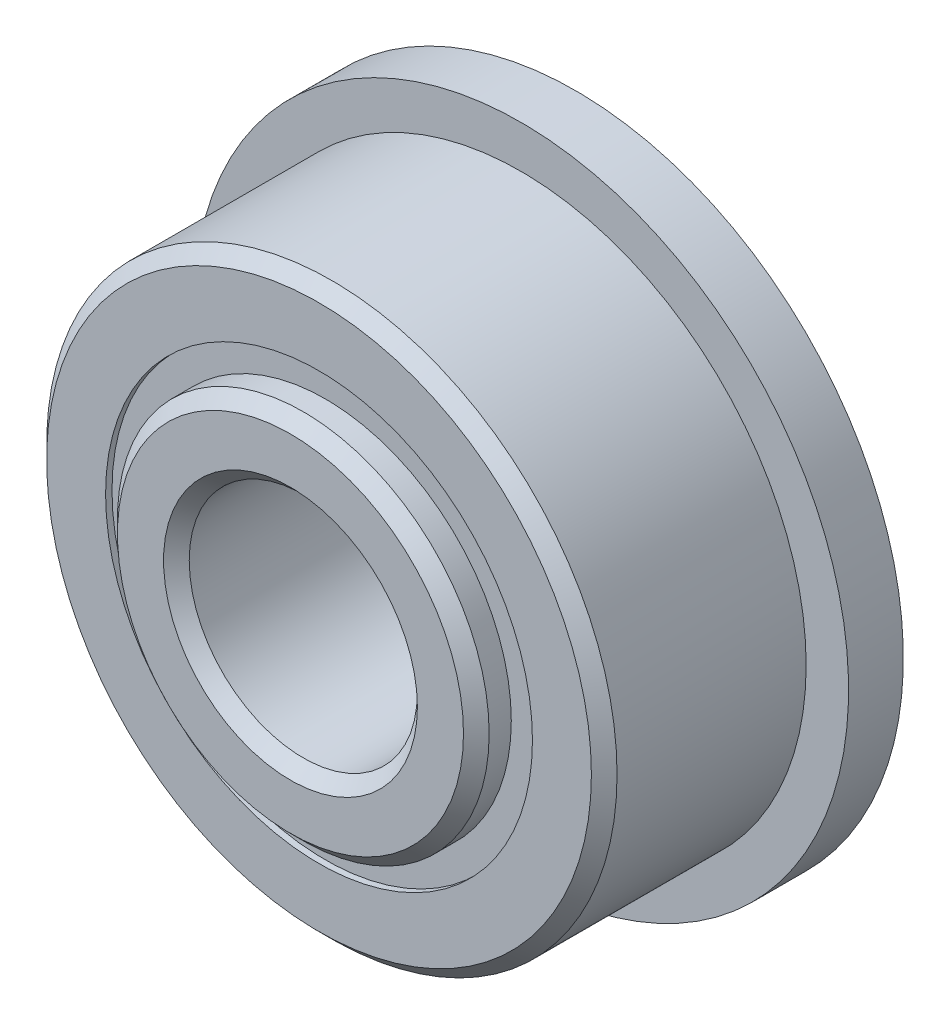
ISO-10303-21;
HEADER;
FILE_DESCRIPTION(('STEP AP214'),'2;1');
FILE_NAME('part.step','',(''),(''),'','','');
FILE_SCHEMA(('AUTOMOTIVE_DESIGN { 1 0 10303 214 1 1 1 1 }'));
ENDSEC;
DATA;
#1=APPLICATION_CONTEXT('core data for automotive mechanical design processes');
#2=APPLICATION_PROTOCOL_DEFINITION('international standard','automotive_design',2000,#1);
#3=PRODUCT_CONTEXT('',#1,'mechanical');
#4=PRODUCT('Part','Part','',(#3));
#5=PRODUCT_RELATED_PRODUCT_CATEGORY('part','',(#4));
#6=PRODUCT_DEFINITION_FORMATION('','',#4);
#7=PRODUCT_DEFINITION_CONTEXT('part definition',#1,'design');
#8=PRODUCT_DEFINITION('design','',#6,#7);
#9=PRODUCT_DEFINITION_SHAPE('','',#8);
#10=(LENGTH_UNIT() NAMED_UNIT(*) SI_UNIT(.MILLI.,.METRE.));
#11=(NAMED_UNIT(*) PLANE_ANGLE_UNIT() SI_UNIT($,.RADIAN.));
#12=(NAMED_UNIT(*) SI_UNIT($,.STERADIAN.) SOLID_ANGLE_UNIT());
#13=UNCERTAINTY_MEASURE_WITH_UNIT(LENGTH_MEASURE(1.E-05),#10,'distance_accuracy_value','');
#14=(GEOMETRIC_REPRESENTATION_CONTEXT(3) GLOBAL_UNCERTAINTY_ASSIGNED_CONTEXT((#13)) GLOBAL_UNIT_ASSIGNED_CONTEXT((#10,
#11,#12)) REPRESENTATION_CONTEXT('',''));
#15=CARTESIAN_POINT('',(0.,0.,0.));
#16=DIRECTION('',(0.,0.,1.));
#17=DIRECTION('',(1.,0.,0.));
#18=AXIS2_PLACEMENT_3D('',#15,#16,#17);
#19=CARTESIAN_POINT('',(0.,2.97002060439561,-1.696640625));
#20=DIRECTION('',(0.,0.,1.));
#21=DIRECTION('',(1.,0.,0.));
#22=AXIS2_PLACEMENT_3D('',#19,#20,#21);
#23=PLANE('',#22);
#24=CARTESIAN_POINT('',(0.,0.,-1.696640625));
#25=DIRECTION('',(0.,0.,1.));
#26=DIRECTION('',(1.,0.,0.));
#27=AXIS2_PLACEMENT_3D('',#24,#25,#26);
#28=CIRCLE('',#27,2.97002060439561);
#29=CARTESIAN_POINT('',(2.97002060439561,0.,-1.696640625));
#30=VERTEX_POINT('',#29);
#31=EDGE_CURVE('E64',#30,#30,#28,.T.);
#32=ORIENTED_EDGE('',*,*,#31,.F.);
#33=EDGE_LOOP('',(#32));
#34=FACE_BOUND('',#33,.T.);
#35=CARTESIAN_POINT('',(0.,0.,-1.696640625));
#36=DIRECTION('',(0.,0.,1.));
#37=DIRECTION('',(1.,0.,0.));
#38=AXIS2_PLACEMENT_3D('',#35,#36,#37);
#39=CIRCLE('',#38,2.5862293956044);
#40=CARTESIAN_POINT('',(2.5862293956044,0.,-1.696640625));
#41=VERTEX_POINT('',#40);
#42=EDGE_CURVE('E11',#41,#41,#39,.T.);
#43=ORIENTED_EDGE('',*,*,#42,.T.);
#44=EDGE_LOOP('',(#43));
#45=FACE_BOUND('',#44,.T.);
#46=ADVANCED_FACE('F47',(#34,#45),#23,.F.);
#47=CARTESIAN_POINT('',(0.,0.,1.7859375));
#48=DIRECTION('',(0.,0.,1.));
#49=DIRECTION('',(1.,0.,0.));
#50=AXIS2_PLACEMENT_3D('',#47,#48,#49);
#51=CYLINDRICAL_SURFACE('',#50,2.5862293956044);
#52=ORIENTED_EDGE('',*,*,#42,.F.);
#53=EDGE_LOOP('',(#52));
#54=FACE_BOUND('',#53,.T.);
#55=CARTESIAN_POINT('',(0.,0.,-0.816616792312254));
#56=DIRECTION('',(0.,0.,1.));
#57=DIRECTION('',(1.,0.,0.));
#58=AXIS2_PLACEMENT_3D('',#55,#56,#57);
#59=CIRCLE('',#58,2.5862293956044);
#60=CARTESIAN_POINT('',(2.5862293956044,0.,-0.816616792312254));
#61=VERTEX_POINT('',#60);
#62=EDGE_CURVE('E54',#61,#61,#59,.T.);
#63=ORIENTED_EDGE('',*,*,#62,.T.);
#64=EDGE_LOOP('',(#63));
#65=FACE_BOUND('',#64,.T.);
#66=ADVANCED_FACE('F74',(#54,#65),#51,.F.);
#67=CARTESIAN_POINT('',(0.,2.9700206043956,-0.816616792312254));
#68=DIRECTION('',(0.,0.,-1.));
#69=DIRECTION('',(-1.,0.,0.));
#70=AXIS2_PLACEMENT_3D('',#67,#68,#69);
#71=PLANE('',#70);
#72=ORIENTED_EDGE('',*,*,#62,.F.);
#73=EDGE_LOOP('',(#72));
#74=FACE_BOUND('',#73,.T.);
#75=CARTESIAN_POINT('',(0.,0.,-0.816616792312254));
#76=DIRECTION('',(0.,0.,1.));
#77=DIRECTION('',(1.,0.,0.));
#78=AXIS2_PLACEMENT_3D('',#75,#76,#77);
#79=CIRCLE('',#78,2.9700206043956);
#80=CARTESIAN_POINT('',(2.9700206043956,0.,-0.816616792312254));
#81=VERTEX_POINT('',#80);
#82=EDGE_CURVE('E60',#81,#81,#79,.T.);
#83=ORIENTED_EDGE('',*,*,#82,.T.);
#84=EDGE_LOOP('',(#83));
#85=FACE_BOUND('',#84,.T.);
#86=ADVANCED_FACE('F78',(#74,#85),#71,.F.);
#87=CARTESIAN_POINT('',(0.,0.,1.7859375));
#88=DIRECTION('',(0.,0.,1.));
#89=DIRECTION('',(1.,0.,0.));
#90=AXIS2_PLACEMENT_3D('',#87,#88,#89);
#91=CYLINDRICAL_SURFACE('',#90,2.9700206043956);
#92=ORIENTED_EDGE('',*,*,#82,.F.);
#93=EDGE_LOOP('',(#92));
#94=FACE_BOUND('',#93,.T.);
#95=ORIENTED_EDGE('',*,*,#31,.T.);
#96=EDGE_LOOP('',(#95));
#97=FACE_BOUND('',#96,.T.);
#98=ADVANCED_FACE('F71',(#94,#97),#91,.T.);
#99=CLOSED_SHELL('',(#46,#66,#86,#98));
#100=MANIFOLD_SOLID_BREP('B2',#99);
#101=CARTESIAN_POINT('',(0.,2.9700206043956,1.696640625));
#102=DIRECTION('',(0.,0.,-1.));
#103=DIRECTION('',(-1.,0.,0.));
#104=AXIS2_PLACEMENT_3D('',#101,#102,#103);
#105=PLANE('',#104);
#106=CARTESIAN_POINT('',(0.,0.,1.696640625));
#107=DIRECTION('',(0.,0.,1.));
#108=DIRECTION('',(1.,0.,0.));
#109=AXIS2_PLACEMENT_3D('',#106,#107,#108);
#110=CIRCLE('',#109,2.5862293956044);
#111=CARTESIAN_POINT('',(2.5862293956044,0.,1.696640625));
#112=VERTEX_POINT('',#111);
#113=EDGE_CURVE('E46',#112,#112,#110,.T.);
#114=ORIENTED_EDGE('',*,*,#113,.F.);
#115=EDGE_LOOP('',(#114));
#116=FACE_BOUND('',#115,.T.);
#117=CARTESIAN_POINT('',(0.,0.,1.696640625));
#118=DIRECTION('',(0.,0.,1.));
#119=DIRECTION('',(1.,0.,0.));
#120=AXIS2_PLACEMENT_3D('',#117,#118,#119);
#121=CIRCLE('',#120,2.9700206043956);
#122=CARTESIAN_POINT('',(2.9700206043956,0.,1.696640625));
#123=VERTEX_POINT('',#122);
#124=EDGE_CURVE('E139',#123,#123,#121,.T.);
#125=ORIENTED_EDGE('',*,*,#124,.T.);
#126=EDGE_LOOP('',(#125));
#127=FACE_BOUND('',#126,.T.);
#128=ADVANCED_FACE('F122',(#116,#127),#105,.F.);
#129=CARTESIAN_POINT('',(0.,0.,1.7859375));
#130=DIRECTION('',(0.,0.,1.));
#131=DIRECTION('',(1.,0.,0.));
#132=AXIS2_PLACEMENT_3D('',#129,#130,#131);
#133=CYLINDRICAL_SURFACE('',#132,2.5862293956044);
#134=CARTESIAN_POINT('',(0.,0.,0.816616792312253));
#135=DIRECTION('',(0.,0.,1.));
#136=DIRECTION('',(1.,0.,0.));
#137=AXIS2_PLACEMENT_3D('',#134,#135,#136);
#138=CIRCLE('',#137,2.5862293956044);
#139=CARTESIAN_POINT('',(2.5862293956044,0.,0.816616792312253));
#140=VERTEX_POINT('',#139);
#141=EDGE_CURVE('E129',#140,#140,#138,.T.);
#142=ORIENTED_EDGE('',*,*,#141,.F.);
#143=EDGE_LOOP('',(#142));
#144=FACE_BOUND('',#143,.T.);
#145=ORIENTED_EDGE('',*,*,#113,.T.);
#146=EDGE_LOOP('',(#145));
#147=FACE_BOUND('',#146,.T.);
#148=ADVANCED_FACE('F155',(#144,#147),#133,.F.);
#149=CARTESIAN_POINT('',(0.,2.9700206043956,0.816616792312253));
#150=DIRECTION('',(0.,0.,1.));
#151=DIRECTION('',(1.,0.,0.));
#152=AXIS2_PLACEMENT_3D('',#149,#150,#151);
#153=PLANE('',#152);
#154=CARTESIAN_POINT('',(0.,0.,0.816616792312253));
#155=DIRECTION('',(0.,0.,1.));
#156=DIRECTION('',(1.,0.,0.));
#157=AXIS2_PLACEMENT_3D('',#154,#155,#156);
#158=CIRCLE('',#157,2.9700206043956);
#159=CARTESIAN_POINT('',(2.9700206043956,0.,0.816616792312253));
#160=VERTEX_POINT('',#159);
#161=EDGE_CURVE('E135',#160,#160,#158,.T.);
#162=ORIENTED_EDGE('',*,*,#161,.F.);
#163=EDGE_LOOP('',(#162));
#164=FACE_BOUND('',#163,.T.);
#165=ORIENTED_EDGE('',*,*,#141,.T.);
#166=EDGE_LOOP('',(#165));
#167=FACE_BOUND('',#166,.T.);
#168=ADVANCED_FACE('F150',(#164,#167),#153,.F.);
#169=CARTESIAN_POINT('',(0.,0.,1.7859375));
#170=DIRECTION('',(0.,0.,1.));
#171=DIRECTION('',(1.,0.,0.));
#172=AXIS2_PLACEMENT_3D('',#169,#170,#171);
#173=CYLINDRICAL_SURFACE('',#172,2.9700206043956);
#174=ORIENTED_EDGE('',*,*,#124,.F.);
#175=EDGE_LOOP('',(#174));
#176=FACE_BOUND('',#175,.T.);
#177=ORIENTED_EDGE('',*,*,#161,.T.);
#178=EDGE_LOOP('',(#177));
#179=FACE_BOUND('',#178,.T.);
#180=ADVANCED_FACE('F147',(#176,#179),#173,.T.);
#181=CLOSED_SHELL('',(#128,#148,#168,#180));
#182=MANIFOLD_SOLID_BREP('B6',#181);
#183=CARTESIAN_POINT('',(-1.632940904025,2.24755033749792,0.));
#184=DIRECTION('',(0.,0.,1.));
#185=DIRECTION('',(-0.587785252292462,0.809016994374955,0.));
#186=AXIS2_PLACEMENT_3D('',#183,#184,#185);
#187=SPHERICAL_SURFACE('',#186,0.816616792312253);
#188=CARTESIAN_POINT('',(-1.632940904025,2.24755033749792,0.816616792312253));
#189=VERTEX_POINT('',#188);
#190=VERTEX_LOOP('',#189);
#191=FACE_BOUND('',#190,.T.);
#192=ADVANCED_FACE('F197',(#191),#187,.T.);
#193=CLOSED_SHELL('',(#192));
#194=MANIFOLD_SOLID_BREP('B41',#193);
#195=CARTESIAN_POINT('',(-2.64215388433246,0.858487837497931,0.));
#196=DIRECTION('',(0.,0.,1.));
#197=DIRECTION('',(-0.95105651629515,0.309016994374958,0.));
#198=AXIS2_PLACEMENT_3D('',#195,#196,#197);
#199=SPHERICAL_SURFACE('',#198,0.816616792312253);
#200=CARTESIAN_POINT('',(-2.64215388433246,0.858487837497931,0.816616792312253));
#201=VERTEX_POINT('',#200);
#202=VERTEX_LOOP('',#201);
#203=FACE_BOUND('',#202,.T.);
#204=ADVANCED_FACE('F218',(#203),#199,.T.);
#205=CLOSED_SHELL('',(#204));
#206=MANIFOLD_SOLID_BREP('B118',#205);
#207=CARTESIAN_POINT('',(-2.64215388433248,-0.858487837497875,0.));
#208=DIRECTION('',(0.,0.,1.));
#209=DIRECTION('',(-0.951056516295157,-0.309016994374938,0.));
#210=AXIS2_PLACEMENT_3D('',#207,#208,#209);
#211=SPHERICAL_SURFACE('',#210,0.816616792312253);
#212=CARTESIAN_POINT('',(-2.64215388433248,-0.858487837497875,0.816616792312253));
#213=VERTEX_POINT('',#212);
#214=VERTEX_LOOP('',#213);
#215=FACE_BOUND('',#214,.T.);
#216=ADVANCED_FACE('F239',(#215),#211,.T.);
#217=CLOSED_SHELL('',(#216));
#218=MANIFOLD_SOLID_BREP('B193',#217);
#219=CARTESIAN_POINT('',(-1.63294090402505,-2.24755033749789,0.));
#220=DIRECTION('',(0.,0.,1.));
#221=DIRECTION('',(-0.58778525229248,-0.809016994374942,0.));
#222=AXIS2_PLACEMENT_3D('',#219,#220,#221);
#223=SPHERICAL_SURFACE('',#222,0.816616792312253);
#224=CARTESIAN_POINT('',(-1.63294090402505,-2.24755033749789,0.816616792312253));
#225=VERTEX_POINT('',#224);
#226=VERTEX_LOOP('',#225);
#227=FACE_BOUND('',#226,.T.);
#228=ADVANCED_FACE('F260',(#227),#223,.T.);
#229=CLOSED_SHELL('',(#228));
#230=MANIFOLD_SOLID_BREP('B214',#229);
#231=CARTESIAN_POINT('',(0.,-2.778125,0.));
#232=DIRECTION('',(0.,0.,1.));
#233=DIRECTION('',(0.,-1.,0.));
#234=AXIS2_PLACEMENT_3D('',#231,#232,#233);
#235=SPHERICAL_SURFACE('',#234,0.816616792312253);
#236=CARTESIAN_POINT('',(0.,-2.778125,0.816616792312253));
#237=VERTEX_POINT('',#236);
#238=VERTEX_LOOP('',#237);
#239=FACE_BOUND('',#238,.T.);
#240=ADVANCED_FACE('F281',(#239),#235,.T.);
#241=CLOSED_SHELL('',(#240));
#242=MANIFOLD_SOLID_BREP('B235',#241);
#243=CARTESIAN_POINT('',(1.63294090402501,-2.24755033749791,0.));
#244=DIRECTION('',(0.,0.,1.));
#245=DIRECTION('',(0.587785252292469,-0.809016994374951,0.));
#246=AXIS2_PLACEMENT_3D('',#243,#244,#245);
#247=SPHERICAL_SURFACE('',#246,0.816616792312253);
#248=CARTESIAN_POINT('',(1.63294090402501,-2.24755033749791,0.816616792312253));
#249=VERTEX_POINT('',#248);
#250=VERTEX_LOOP('',#249);
#251=FACE_BOUND('',#250,.T.);
#252=ADVANCED_FACE('F302',(#251),#247,.T.);
#253=CLOSED_SHELL('',(#252));
#254=MANIFOLD_SOLID_BREP('B256',#253);
#255=CARTESIAN_POINT('',(2.64215388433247,-0.858487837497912,0.));
#256=DIRECTION('',(0.,0.,1.));
#257=DIRECTION('',(0.951056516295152,-0.309016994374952,0.));
#258=AXIS2_PLACEMENT_3D('',#255,#256,#257);
#259=SPHERICAL_SURFACE('',#258,0.816616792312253);
#260=CARTESIAN_POINT('',(2.64215388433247,-0.858487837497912,0.816616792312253));
#261=VERTEX_POINT('',#260);
#262=VERTEX_LOOP('',#261);
#263=FACE_BOUND('',#262,.T.);
#264=ADVANCED_FACE('F323',(#263),#259,.T.);
#265=CLOSED_SHELL('',(#264));
#266=MANIFOLD_SOLID_BREP('B277',#265);
#267=CARTESIAN_POINT('',(2.64215388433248,0.858487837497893,0.));
#268=DIRECTION('',(0.,0.,1.));
#269=DIRECTION('',(0.951056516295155,0.309016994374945,0.));
#270=AXIS2_PLACEMENT_3D('',#267,#268,#269);
#271=SPHERICAL_SURFACE('',#270,0.816616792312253);
#272=CARTESIAN_POINT('',(2.64215388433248,0.858487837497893,0.816616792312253));
#273=VERTEX_POINT('',#272);
#274=VERTEX_LOOP('',#273);
#275=FACE_BOUND('',#274,.T.);
#276=ADVANCED_FACE('F343',(#275),#271,.T.);
#277=CLOSED_SHELL('',(#276));
#278=MANIFOLD_SOLID_BREP('B298',#277);
#279=CARTESIAN_POINT('',(1.63294090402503,2.2475503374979,0.));
#280=DIRECTION('',(0.,0.,1.));
#281=DIRECTION('',(0.587785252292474,0.809016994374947,0.));
#282=AXIS2_PLACEMENT_3D('',#279,#280,#281);
#283=SPHERICAL_SURFACE('',#282,0.816616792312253);
#284=CARTESIAN_POINT('',(1.63294090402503,2.2475503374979,0.816616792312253));
#285=VERTEX_POINT('',#284);
#286=VERTEX_LOOP('',#285);
#287=FACE_BOUND('',#286,.T.);
#288=ADVANCED_FACE('F364',(#287),#283,.T.);
#289=CLOSED_SHELL('',(#288));
#290=MANIFOLD_SOLID_BREP('B319',#289);
#291=CARTESIAN_POINT('',(0.,2.778125,0.));
#292=DIRECTION('',(0.,0.,1.));
#293=DIRECTION('',(0.,1.,0.));
#294=AXIS2_PLACEMENT_3D('',#291,#292,#293);
#295=SPHERICAL_SURFACE('',#294,0.816616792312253);
#296=CARTESIAN_POINT('',(0.,2.778125,0.816616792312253));
#297=VERTEX_POINT('',#296);
#298=VERTEX_LOOP('',#297);
#299=FACE_BOUND('',#298,.T.);
#300=ADVANCED_FACE('F387',(#299),#295,.T.);
#301=CLOSED_SHELL('',(#300));
#302=MANIFOLD_SOLID_BREP('B339',#301);
#303=CARTESIAN_POINT('',(0.,0.,2.00453625));
#304=DIRECTION('',(0.,0.,-1.));
#305=DIRECTION('',(-1.,0.,0.));
#306=AXIS2_PLACEMENT_3D('',#303,#304,#305);
#307=CONICAL_SURFACE('',#306,2.5862293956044,0.785398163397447);
#308=CARTESIAN_POINT('',(0.,0.,2.18313));
#309=DIRECTION('',(0.,0.,1.));
#310=DIRECTION('',(1.,0.,0.));
#311=AXIS2_PLACEMENT_3D('',#308,#309,#310);
#312=CIRCLE('',#311,2.4076356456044);
#313=CARTESIAN_POINT('',(2.4076356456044,0.,2.18313));
#314=VERTEX_POINT('',#313);
#315=EDGE_CURVE('E451',#314,#314,#312,.T.);
#316=ORIENTED_EDGE('',*,*,#315,.F.);
#317=EDGE_LOOP('',(#316));
#318=FACE_BOUND('',#317,.T.);
#319=CARTESIAN_POINT('',(0.,0.,2.00453625));
#320=DIRECTION('',(0.,0.,1.));
#321=DIRECTION('',(1.,0.,0.));
#322=AXIS2_PLACEMENT_3D('',#319,#320,#321);
#323=CIRCLE('',#322,2.5862293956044);
#324=CARTESIAN_POINT('',(2.5862293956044,0.,2.00453625));
#325=VERTEX_POINT('',#324);
#326=EDGE_CURVE('E386',#325,#325,#323,.T.);
#327=ORIENTED_EDGE('',*,*,#326,.T.);
#328=EDGE_LOOP('',(#327));
#329=FACE_BOUND('',#328,.T.);
#330=ADVANCED_FACE('F407',(#318,#329),#307,.T.);
#331=CARTESIAN_POINT('',(0.,0.,1.7859375));
#332=DIRECTION('',(0.,0.,1.));
#333=DIRECTION('',(1.,0.,0.));
#334=AXIS2_PLACEMENT_3D('',#331,#332,#333);
#335=CYLINDRICAL_SURFACE('',#334,2.5862293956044);
#336=ORIENTED_EDGE('',*,*,#326,.F.);
#337=EDGE_LOOP('',(#336));
#338=FACE_BOUND('',#337,.T.);
#339=CARTESIAN_POINT('',(0.,0.,0.793749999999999));
#340=DIRECTION('',(0.,0.,1.));
#341=DIRECTION('',(1.,0.,0.));
#342=AXIS2_PLACEMENT_3D('',#339,#340,#341);
#343=CIRCLE('',#342,2.5862293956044);
#344=CARTESIAN_POINT('',(2.5862293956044,0.,0.793749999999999));
#345=VERTEX_POINT('',#344);
#346=EDGE_CURVE('E414',#345,#345,#343,.T.);
#347=ORIENTED_EDGE('',*,*,#346,.T.);
#348=EDGE_LOOP('',(#347));
#349=FACE_BOUND('',#348,.T.);
#350=ADVANCED_FACE('F458',(#338,#349),#335,.T.);
#351=CARTESIAN_POINT('',(0.,0.,0.));
#352=DIRECTION('',(0.,0.,1.));
#353=DIRECTION('',(1.,0.,0.));
#354=AXIS2_PLACEMENT_3D('',#351,#352,#353);
#355=TOROIDAL_SURFACE('',#354,2.77812499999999,0.816616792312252);
#356=ORIENTED_EDGE('',*,*,#346,.F.);
#357=EDGE_LOOP('',(#356));
#358=FACE_BOUND('',#357,.T.);
#359=CARTESIAN_POINT('',(0.,0.,-0.79375));
#360=DIRECTION('',(0.,0.,1.));
#361=DIRECTION('',(1.,0.,0.));
#362=AXIS2_PLACEMENT_3D('',#359,#360,#361);
#363=CIRCLE('',#362,2.5862293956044);
#364=CARTESIAN_POINT('',(2.5862293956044,0.,-0.79375));
#365=VERTEX_POINT('',#364);
#366=EDGE_CURVE('E420',#365,#365,#363,.T.);
#367=ORIENTED_EDGE('',*,*,#366,.T.);
#368=EDGE_LOOP('',(#367));
#369=FACE_BOUND('',#368,.T.);
#370=ADVANCED_FACE('F462',(#358,#369),#355,.F.);
#371=CARTESIAN_POINT('',(0.,0.,1.7859375));
#372=DIRECTION('',(0.,0.,1.));
#373=DIRECTION('',(1.,0.,0.));
#374=AXIS2_PLACEMENT_3D('',#371,#372,#373);
#375=CYLINDRICAL_SURFACE('',#374,2.5862293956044);
#376=ORIENTED_EDGE('',*,*,#366,.F.);
#377=EDGE_LOOP('',(#376));
#378=FACE_BOUND('',#377,.T.);
#379=CARTESIAN_POINT('',(0.,0.,-2.00453625));
#380=DIRECTION('',(0.,0.,1.));
#381=DIRECTION('',(1.,0.,0.));
#382=AXIS2_PLACEMENT_3D('',#379,#380,#381);
#383=CIRCLE('',#382,2.5862293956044);
#384=CARTESIAN_POINT('',(2.5862293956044,0.,-2.00453625));
#385=VERTEX_POINT('',#384);
#386=EDGE_CURVE('E426',#385,#385,#383,.T.);
#387=ORIENTED_EDGE('',*,*,#386,.T.);
#388=EDGE_LOOP('',(#387));
#389=FACE_BOUND('',#388,.T.);
#390=ADVANCED_FACE('F467',(#378,#389),#375,.T.);
#391=CARTESIAN_POINT('',(0.,0.,-2.18313));
#392=DIRECTION('',(0.,0.,1.));
#393=DIRECTION('',(1.,0.,0.));
#394=AXIS2_PLACEMENT_3D('',#391,#392,#393);
#395=CONICAL_SURFACE('',#394,2.4076356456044,0.785398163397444);
#396=ORIENTED_EDGE('',*,*,#386,.F.);
#397=EDGE_LOOP('',(#396));
#398=FACE_BOUND('',#397,.T.);
#399=CARTESIAN_POINT('',(0.,0.,-2.18313));
#400=DIRECTION('',(0.,0.,1.));
#401=DIRECTION('',(1.,0.,0.));
#402=AXIS2_PLACEMENT_3D('',#399,#400,#401);
#403=CIRCLE('',#402,2.4076356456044);
#404=CARTESIAN_POINT('',(2.4076356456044,0.,-2.18313));
#405=VERTEX_POINT('',#404);
#406=EDGE_CURVE('E432',#405,#405,#403,.T.);
#407=ORIENTED_EDGE('',*,*,#406,.T.);
#408=EDGE_LOOP('',(#407));
#409=FACE_BOUND('',#408,.T.);
#410=ADVANCED_FACE('F473',(#398,#409),#395,.T.);
#411=CARTESIAN_POINT('',(0.,2.4076356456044,-2.18313));
#412=DIRECTION('',(0.,0.,1.));
#413=DIRECTION('',(1.,0.,0.));
#414=AXIS2_PLACEMENT_3D('',#411,#412,#413);
#415=PLANE('',#414);
#416=ORIENTED_EDGE('',*,*,#406,.F.);
#417=EDGE_LOOP('',(#416));
#418=FACE_BOUND('',#417,.T.);
#419=CARTESIAN_POINT('',(0.,0.,-2.18313));
#420=DIRECTION('',(0.,0.,1.));
#421=DIRECTION('',(1.,0.,0.));
#422=AXIS2_PLACEMENT_3D('',#419,#420,#421);
#423=CIRCLE('',#422,1.76609375);
#424=CARTESIAN_POINT('',(1.76609375,0.,-2.18313));
#425=VERTEX_POINT('',#424);
#426=EDGE_CURVE('E436',#425,#425,#423,.T.);
#427=ORIENTED_EDGE('',*,*,#426,.T.);
#428=EDGE_LOOP('',(#427));
#429=FACE_BOUND('',#428,.T.);
#430=ADVANCED_FACE('F477',(#418,#429),#415,.F.);
#431=CARTESIAN_POINT('',(0.,0.,-2.00453625));
#432=DIRECTION('',(0.,0.,-1.));
#433=DIRECTION('',(-1.,0.,0.));
#434=AXIS2_PLACEMENT_3D('',#431,#432,#433);
#435=CONICAL_SURFACE('',#434,1.5875,0.785398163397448);
#436=ORIENTED_EDGE('',*,*,#426,.F.);
#437=EDGE_LOOP('',(#436));
#438=FACE_BOUND('',#437,.T.);
#439=CARTESIAN_POINT('',(0.,0.,-2.00453625));
#440=DIRECTION('',(0.,0.,1.));
#441=DIRECTION('',(1.,0.,0.));
#442=AXIS2_PLACEMENT_3D('',#439,#440,#441);
#443=CIRCLE('',#442,1.5875);
#444=CARTESIAN_POINT('',(1.5875,0.,-2.00453625));
#445=VERTEX_POINT('',#444);
#446=EDGE_CURVE('E440',#445,#445,#443,.T.);
#447=ORIENTED_EDGE('',*,*,#446,.T.);
#448=EDGE_LOOP('',(#447));
#449=FACE_BOUND('',#448,.T.);
#450=ADVANCED_FACE('F481',(#438,#449),#435,.F.);
#451=CARTESIAN_POINT('',(0.,0.,1.7859375));
#452=DIRECTION('',(0.,0.,1.));
#453=DIRECTION('',(1.,0.,0.));
#454=AXIS2_PLACEMENT_3D('',#451,#452,#453);
#455=CYLINDRICAL_SURFACE('',#454,1.5875);
#456=ORIENTED_EDGE('',*,*,#446,.F.);
#457=EDGE_LOOP('',(#456));
#458=FACE_BOUND('',#457,.T.);
#459=CARTESIAN_POINT('',(0.,0.,2.00453625));
#460=DIRECTION('',(0.,0.,1.));
#461=DIRECTION('',(1.,0.,0.));
#462=AXIS2_PLACEMENT_3D('',#459,#460,#461);
#463=CIRCLE('',#462,1.5875);
#464=CARTESIAN_POINT('',(1.5875,0.,2.00453625));
#465=VERTEX_POINT('',#464);
#466=EDGE_CURVE('E443',#465,#465,#463,.T.);
#467=ORIENTED_EDGE('',*,*,#466,.T.);
#468=EDGE_LOOP('',(#467));
#469=FACE_BOUND('',#468,.T.);
#470=ADVANCED_FACE('F485',(#458,#469),#455,.F.);
#471=CARTESIAN_POINT('',(0.,0.,2.18313));
#472=DIRECTION('',(0.,0.,1.));
#473=DIRECTION('',(1.,0.,0.));
#474=AXIS2_PLACEMENT_3D('',#471,#472,#473);
#475=CONICAL_SURFACE('',#474,1.76609375,0.785398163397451);
#476=ORIENTED_EDGE('',*,*,#466,.F.);
#477=EDGE_LOOP('',(#476));
#478=FACE_BOUND('',#477,.T.);
#479=CARTESIAN_POINT('',(0.,0.,2.18313));
#480=DIRECTION('',(0.,0.,1.));
#481=DIRECTION('',(1.,0.,0.));
#482=AXIS2_PLACEMENT_3D('',#479,#480,#481);
#483=CIRCLE('',#482,1.76609375);
#484=CARTESIAN_POINT('',(1.76609375,0.,2.18313));
#485=VERTEX_POINT('',#484);
#486=EDGE_CURVE('E447',#485,#485,#483,.T.);
#487=ORIENTED_EDGE('',*,*,#486,.T.);
#488=EDGE_LOOP('',(#487));
#489=FACE_BOUND('',#488,.T.);
#490=ADVANCED_FACE('F489',(#478,#489),#475,.F.);
#491=CARTESIAN_POINT('',(0.,1.76609375,2.18313));
#492=DIRECTION('',(0.,0.,-1.));
#493=DIRECTION('',(-1.,0.,0.));
#494=AXIS2_PLACEMENT_3D('',#491,#492,#493);
#495=PLANE('',#494);
#496=ORIENTED_EDGE('',*,*,#486,.F.);
#497=EDGE_LOOP('',(#496));
#498=FACE_BOUND('',#497,.T.);
#499=ORIENTED_EDGE('',*,*,#315,.T.);
#500=EDGE_LOOP('',(#499));
#501=FACE_BOUND('',#500,.T.);
#502=ADVANCED_FACE('F455',(#498,#501),#495,.F.);
#503=CLOSED_SHELL('',(#330,#350,#370,#390,#410,#430,#450,#470,#490,#502));
#504=MANIFOLD_SOLID_BREP('B360',#503);
#505=CARTESIAN_POINT('',(0.,0.,1.60734375));
#506=DIRECTION('',(0.,0.,-1.));
#507=DIRECTION('',(-1.,0.,0.));
#508=AXIS2_PLACEMENT_3D('',#505,#506,#507);
#509=CONICAL_SURFACE('',#508,3.96875,0.785398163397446);
#510=CARTESIAN_POINT('',(0.,0.,1.7859375));
#511=DIRECTION('',(0.,0.,1.));
#512=DIRECTION('',(1.,0.,0.));
#513=AXIS2_PLACEMENT_3D('',#510,#511,#512);
#514=CIRCLE('',#513,3.79015625);
#515=CARTESIAN_POINT('',(3.79015625,0.,1.7859375));
#516=VERTEX_POINT('',#515);
#517=EDGE_CURVE('E605',#516,#516,#514,.T.);
#518=ORIENTED_EDGE('',*,*,#517,.F.);
#519=EDGE_LOOP('',(#518));
#520=FACE_BOUND('',#519,.T.);
#521=CARTESIAN_POINT('',(0.,0.,1.60734375));
#522=DIRECTION('',(0.,0.,1.));
#523=DIRECTION('',(1.,0.,0.));
#524=AXIS2_PLACEMENT_3D('',#521,#522,#523);
#525=CIRCLE('',#524,3.96875);
#526=CARTESIAN_POINT('',(3.96875,0.,1.60734375));
#527=VERTEX_POINT('',#526);
#528=EDGE_CURVE('E406',#527,#527,#525,.T.);
#529=ORIENTED_EDGE('',*,*,#528,.T.);
#530=EDGE_LOOP('',(#529));
#531=FACE_BOUND('',#530,.T.);
#532=ADVANCED_FACE('F575',(#520,#531),#509,.T.);
#533=CARTESIAN_POINT('',(0.,0.,1.7859375));
#534=DIRECTION('',(0.,0.,1.));
#535=DIRECTION('',(1.,0.,0.));
#536=AXIS2_PLACEMENT_3D('',#533,#534,#535);
#537=CYLINDRICAL_SURFACE('',#536,3.96875);
#538=CARTESIAN_POINT('',(0.,0.,-1.0239375));
#539=DIRECTION('',(0.,0.,1.));
#540=DIRECTION('',(1.,0.,0.));
#541=AXIS2_PLACEMENT_3D('',#538,#539,#540);
#542=CIRCLE('',#541,3.96875);
#543=CARTESIAN_POINT('',(3.96875,0.,-1.0239375));
#544=VERTEX_POINT('',#543);
#545=EDGE_CURVE('E608',#544,#544,#542,.T.);
#546=ORIENTED_EDGE('',*,*,#545,.T.);
#547=EDGE_LOOP('',(#546));
#548=FACE_BOUND('',#547,.T.);
#549=ORIENTED_EDGE('',*,*,#528,.F.);
#550=EDGE_LOOP('',(#549));
#551=FACE_BOUND('',#550,.T.);
#552=ADVANCED_FACE('F629',(#548,#551),#537,.T.);
#553=CARTESIAN_POINT('',(0.,3.79015625,-1.7859375));
#554=DIRECTION('',(0.,0.,1.));
#555=DIRECTION('',(1.,0.,0.));
#556=AXIS2_PLACEMENT_3D('',#553,#554,#555);
#557=PLANE('',#556);
#558=CARTESIAN_POINT('',(0.,0.,-1.7859375));
#559=DIRECTION('',(0.,0.,1.));
#560=DIRECTION('',(1.,0.,0.));
#561=AXIS2_PLACEMENT_3D('',#558,#559,#560);
#562=CIRCLE('',#561,2.9700206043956);
#563=CARTESIAN_POINT('',(2.9700206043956,0.,-1.7859375));
#564=VERTEX_POINT('',#563);
#565=EDGE_CURVE('E582',#564,#564,#562,.T.);
#566=ORIENTED_EDGE('',*,*,#565,.T.);
#567=EDGE_LOOP('',(#566));
#568=FACE_BOUND('',#567,.T.);
#569=CARTESIAN_POINT('',(0.,0.,-1.7859375));
#570=DIRECTION('',(0.,0.,-1.));
#571=DIRECTION('',(-1.,0.,0.));
#572=AXIS2_PLACEMENT_3D('',#569,#570,#571);
#573=CIRCLE('',#572,4.5593);
#574=CARTESIAN_POINT('',(-4.5593,0.,-1.7859375));
#575=VERTEX_POINT('',#574);
#576=EDGE_CURVE('E611',#575,#575,#573,.T.);
#577=ORIENTED_EDGE('',*,*,#576,.T.);
#578=EDGE_LOOP('',(#577));
#579=FACE_BOUND('',#578,.T.);
#580=ADVANCED_FACE('F632',(#568,#579),#557,.F.);
#581=CARTESIAN_POINT('',(0.,0.,1.7859375));
#582=DIRECTION('',(0.,0.,1.));
#583=DIRECTION('',(1.,0.,0.));
#584=AXIS2_PLACEMENT_3D('',#581,#582,#583);
#585=CYLINDRICAL_SURFACE('',#584,2.9700206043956);
#586=CARTESIAN_POINT('',(0.,0.,-0.79375));
#587=DIRECTION('',(0.,0.,1.));
#588=DIRECTION('',(1.,0.,0.));
#589=AXIS2_PLACEMENT_3D('',#586,#587,#588);
#590=CIRCLE('',#589,2.9700206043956);
#591=CARTESIAN_POINT('',(2.9700206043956,0.,-0.79375));
#592=VERTEX_POINT('',#591);
#593=EDGE_CURVE('E589',#592,#592,#590,.T.);
#594=ORIENTED_EDGE('',*,*,#593,.T.);
#595=EDGE_LOOP('',(#594));
#596=FACE_BOUND('',#595,.T.);
#597=ORIENTED_EDGE('',*,*,#565,.F.);
#598=EDGE_LOOP('',(#597));
#599=FACE_BOUND('',#598,.T.);
#600=ADVANCED_FACE('F637',(#596,#599),#585,.F.);
#601=CARTESIAN_POINT('',(0.,0.,0.));
#602=DIRECTION('',(0.,0.,1.));
#603=DIRECTION('',(1.,0.,0.));
#604=AXIS2_PLACEMENT_3D('',#601,#602,#603);
#605=TOROIDAL_SURFACE('',#604,2.778125,0.816616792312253);
#606=ORIENTED_EDGE('',*,*,#593,.F.);
#607=EDGE_LOOP('',(#606));
#608=FACE_BOUND('',#607,.T.);
#609=CARTESIAN_POINT('',(0.,0.,0.79375));
#610=DIRECTION('',(0.,0.,1.));
#611=DIRECTION('',(1.,0.,0.));
#612=AXIS2_PLACEMENT_3D('',#609,#610,#611);
#613=CIRCLE('',#612,2.9700206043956);
#614=CARTESIAN_POINT('',(2.9700206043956,0.,0.79375));
#615=VERTEX_POINT('',#614);
#616=EDGE_CURVE('E595',#615,#615,#613,.T.);
#617=ORIENTED_EDGE('',*,*,#616,.T.);
#618=EDGE_LOOP('',(#617));
#619=FACE_BOUND('',#618,.T.);
#620=ADVANCED_FACE('F643',(#608,#619),#605,.F.);
#621=CARTESIAN_POINT('',(0.,0.,1.7859375));
#622=DIRECTION('',(0.,0.,1.));
#623=DIRECTION('',(1.,0.,0.));
#624=AXIS2_PLACEMENT_3D('',#621,#622,#623);
#625=CYLINDRICAL_SURFACE('',#624,2.9700206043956);
#626=ORIENTED_EDGE('',*,*,#616,.F.);
#627=EDGE_LOOP('',(#626));
#628=FACE_BOUND('',#627,.T.);
#629=CARTESIAN_POINT('',(0.,0.,1.7859375));
#630=DIRECTION('',(0.,0.,1.));
#631=DIRECTION('',(1.,0.,0.));
#632=AXIS2_PLACEMENT_3D('',#629,#630,#631);
#633=CIRCLE('',#632,2.9700206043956);
#634=CARTESIAN_POINT('',(2.9700206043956,0.,1.7859375));
#635=VERTEX_POINT('',#634);
#636=EDGE_CURVE('E601',#635,#635,#633,.T.);
#637=ORIENTED_EDGE('',*,*,#636,.T.);
#638=EDGE_LOOP('',(#637));
#639=FACE_BOUND('',#638,.T.);
#640=ADVANCED_FACE('F647',(#628,#639),#625,.F.);
#641=CARTESIAN_POINT('',(0.,3.79015625,1.7859375));
#642=DIRECTION('',(0.,0.,-1.));
#643=DIRECTION('',(-1.,0.,0.));
#644=AXIS2_PLACEMENT_3D('',#641,#642,#643);
#645=PLANE('',#644);
#646=ORIENTED_EDGE('',*,*,#636,.F.);
#647=EDGE_LOOP('',(#646));
#648=FACE_BOUND('',#647,.T.);
#649=ORIENTED_EDGE('',*,*,#517,.T.);
#650=EDGE_LOOP('',(#649));
#651=FACE_BOUND('',#650,.T.);
#652=ADVANCED_FACE('F625',(#648,#651),#645,.F.);
#653=CARTESIAN_POINT('',(0.,2.9700206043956,-1.0239375));
#654=DIRECTION('',(0.,0.,1.));
#655=DIRECTION('',(1.,0.,0.));
#656=AXIS2_PLACEMENT_3D('',#653,#654,#655);
#657=PLANE('',#656);
#658=CARTESIAN_POINT('',(0.,0.,-1.0239375));
#659=DIRECTION('',(0.,0.,-1.));
#660=DIRECTION('',(-1.,0.,0.));
#661=AXIS2_PLACEMENT_3D('',#658,#659,#660);
#662=CIRCLE('',#661,4.5593);
#663=CARTESIAN_POINT('',(-4.5593,0.,-1.0239375));
#664=VERTEX_POINT('',#663);
#665=EDGE_CURVE('E614',#664,#664,#662,.T.);
#666=ORIENTED_EDGE('',*,*,#665,.F.);
#667=EDGE_LOOP('',(#666));
#668=FACE_BOUND('',#667,.T.);
#669=ORIENTED_EDGE('',*,*,#545,.F.);
#670=EDGE_LOOP('',(#669));
#671=FACE_BOUND('',#670,.T.);
#672=ADVANCED_FACE('F622',(#668,#671),#657,.T.);
#673=CARTESIAN_POINT('',(0.,0.,-1.7859375));
#674=DIRECTION('',(0.,0.,-1.));
#675=DIRECTION('',(-1.,0.,0.));
#676=AXIS2_PLACEMENT_3D('',#673,#674,#675);
#677=CYLINDRICAL_SURFACE('',#676,4.5593);
#678=ORIENTED_EDGE('',*,*,#665,.T.);
#679=EDGE_LOOP('',(#678));
#680=FACE_BOUND('',#679,.T.);
#681=ORIENTED_EDGE('',*,*,#576,.F.);
#682=EDGE_LOOP('',(#681));
#683=FACE_BOUND('',#682,.T.);
#684=ADVANCED_FACE('F619',(#680,#683),#677,.T.);
#685=CLOSED_SHELL('',(#532,#552,#580,#600,#620,#640,#652,#672,#684));
#686=MANIFOLD_SOLID_BREP('B381',#685);
#687=ADVANCED_BREP_SHAPE_REPRESENTATION('',(#18,#100,#182,#194,#206,#218,#230,#242,#254,#266,
#278,#290,#302,#504,#686),#14);
#688=SHAPE_DEFINITION_REPRESENTATION(#9,#687);
ENDSEC;
END-ISO-10303-21;
